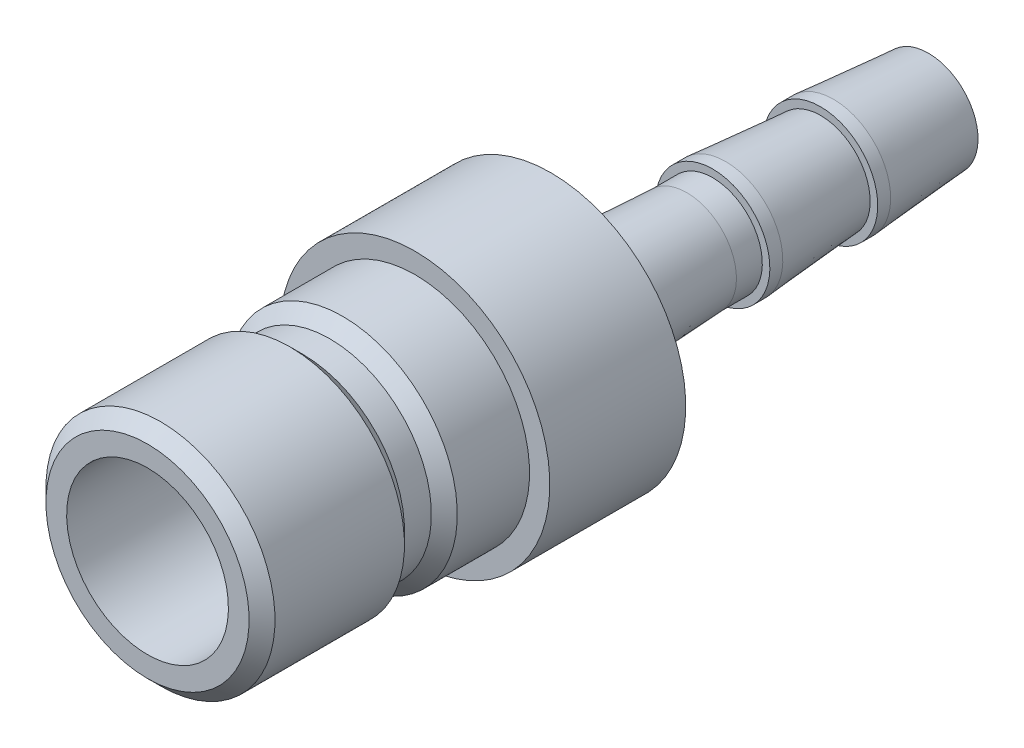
ISO-10303-21;
HEADER;
FILE_DESCRIPTION(('STEP AP214'),'2;1');
FILE_NAME('part.step','',(''),(''),'','','');
FILE_SCHEMA(('AUTOMOTIVE_DESIGN { 1 0 10303 214 1 1 1 1 }'));
ENDSEC;
DATA;
#1=APPLICATION_CONTEXT('core data for automotive mechanical design processes');
#2=APPLICATION_PROTOCOL_DEFINITION('international standard','automotive_design',2000,#1);
#3=PRODUCT_CONTEXT('',#1,'mechanical');
#4=PRODUCT('Part','Part','',(#3));
#5=PRODUCT_RELATED_PRODUCT_CATEGORY('part','',(#4));
#6=PRODUCT_DEFINITION_FORMATION('','',#4);
#7=PRODUCT_DEFINITION_CONTEXT('part definition',#1,'design');
#8=PRODUCT_DEFINITION('design','',#6,#7);
#9=PRODUCT_DEFINITION_SHAPE('','',#8);
#10=(LENGTH_UNIT() NAMED_UNIT(*) SI_UNIT(.MILLI.,.METRE.));
#11=(NAMED_UNIT(*) PLANE_ANGLE_UNIT() SI_UNIT($,.RADIAN.));
#12=(NAMED_UNIT(*) SI_UNIT($,.STERADIAN.) SOLID_ANGLE_UNIT());
#13=UNCERTAINTY_MEASURE_WITH_UNIT(LENGTH_MEASURE(1.E-05),#10,'distance_accuracy_value','');
#14=(GEOMETRIC_REPRESENTATION_CONTEXT(3) GLOBAL_UNCERTAINTY_ASSIGNED_CONTEXT((#13)) GLOBAL_UNIT_ASSIGNED_CONTEXT((#10,
#11,#12)) REPRESENTATION_CONTEXT('',''));
#15=CARTESIAN_POINT('',(0.,0.,0.));
#16=DIRECTION('',(0.,0.,1.));
#17=DIRECTION('',(1.,0.,0.));
#18=AXIS2_PLACEMENT_3D('',#15,#16,#17);
#19=CARTESIAN_POINT('',(0.,0.,0.));
#20=DIRECTION('',(0.,0.,-1.));
#21=DIRECTION('',(0.,1.,0.));
#22=AXIS2_PLACEMENT_3D('',#19,#20,#21);
#23=CYLINDRICAL_SURFACE('',#22,4.7625);
#24=CARTESIAN_POINT('',(0.,0.,3.556));
#25=DIRECTION('',(0.,0.,-1.));
#26=DIRECTION('',(0.,1.,0.));
#27=AXIS2_PLACEMENT_3D('',#24,#25,#26);
#28=CIRCLE('',#27,4.7625);
#29=CARTESIAN_POINT('',(0.,4.7625,3.556));
#30=VERTEX_POINT('',#29);
#31=EDGE_CURVE('E101',#30,#30,#28,.T.);
#32=ORIENTED_EDGE('',*,*,#31,.T.);
#33=EDGE_LOOP('',(#32));
#34=FACE_BOUND('',#33,.T.);
#35=CARTESIAN_POINT('',(0.,0.,15.748));
#36=DIRECTION('',(0.,0.,-1.));
#37=DIRECTION('',(0.,1.,0.));
#38=AXIS2_PLACEMENT_3D('',#35,#36,#37);
#39=CIRCLE('',#38,4.7625);
#40=CARTESIAN_POINT('',(0.,4.7625,15.748));
#41=VERTEX_POINT('',#40);
#42=EDGE_CURVE('E10',#41,#41,#39,.T.);
#43=ORIENTED_EDGE('',*,*,#42,.F.);
#44=EDGE_LOOP('',(#43));
#45=FACE_BOUND('',#44,.T.);
#46=ADVANCED_FACE('F31',(#34,#45),#23,.F.);
#47=CARTESIAN_POINT('',(0.,4.7625,15.748));
#48=DIRECTION('',(0.,0.,1.));
#49=DIRECTION('',(0.,-1.,0.));
#50=AXIS2_PLACEMENT_3D('',#47,#48,#49);
#51=PLANE('',#50);
#52=ORIENTED_EDGE('',*,*,#42,.T.);
#53=EDGE_LOOP('',(#52));
#54=FACE_BOUND('',#53,.T.);
#55=CARTESIAN_POINT('',(0.,0.,15.748));
#56=DIRECTION('',(0.,0.,-1.));
#57=DIRECTION('',(0.,1.,0.));
#58=AXIS2_PLACEMENT_3D('',#55,#56,#57);
#59=CIRCLE('',#58,5.9817);
#60=CARTESIAN_POINT('',(0.,5.9817,15.748));
#61=VERTEX_POINT('',#60);
#62=EDGE_CURVE('E37',#61,#61,#59,.T.);
#63=ORIENTED_EDGE('',*,*,#62,.F.);
#64=EDGE_LOOP('',(#63));
#65=FACE_BOUND('',#64,.T.);
#66=ADVANCED_FACE('F119',(#54,#65),#51,.T.);
#67=CARTESIAN_POINT('',(0.,0.,14.986));
#68=DIRECTION('',(0.,0.,-1.));
#69=DIRECTION('',(0.,1.,0.));
#70=AXIS2_PLACEMENT_3D('',#67,#68,#69);
#71=CONICAL_SURFACE('',#70,6.7437,0.785398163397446);
#72=ORIENTED_EDGE('',*,*,#62,.T.);
#73=EDGE_LOOP('',(#72));
#74=FACE_BOUND('',#73,.T.);
#75=CARTESIAN_POINT('',(0.,0.,14.986));
#76=DIRECTION('',(0.,0.,-1.));
#77=DIRECTION('',(0.,1.,0.));
#78=AXIS2_PLACEMENT_3D('',#75,#76,#77);
#79=CIRCLE('',#78,6.7437);
#80=CARTESIAN_POINT('',(0.,6.7437,14.986));
#81=VERTEX_POINT('',#80);
#82=EDGE_CURVE('E41',#81,#81,#79,.T.);
#83=ORIENTED_EDGE('',*,*,#82,.F.);
#84=EDGE_LOOP('',(#83));
#85=FACE_BOUND('',#84,.T.);
#86=ADVANCED_FACE('F123',(#74,#85),#71,.T.);
#87=CARTESIAN_POINT('',(0.,0.,0.));
#88=DIRECTION('',(0.,0.,-1.));
#89=DIRECTION('',(0.,1.,0.));
#90=AXIS2_PLACEMENT_3D('',#87,#88,#89);
#91=CYLINDRICAL_SURFACE('',#90,6.7437);
#92=ORIENTED_EDGE('',*,*,#82,.T.);
#93=EDGE_LOOP('',(#92));
#94=FACE_BOUND('',#93,.T.);
#95=CARTESIAN_POINT('',(0.,0.,7.36599999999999));
#96=DIRECTION('',(0.,0.,-1.));
#97=DIRECTION('',(0.,1.,0.));
#98=AXIS2_PLACEMENT_3D('',#95,#96,#97);
#99=CIRCLE('',#98,6.7437);
#100=CARTESIAN_POINT('',(0.,6.7437,7.36599999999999));
#101=VERTEX_POINT('',#100);
#102=EDGE_CURVE('E45',#101,#101,#99,.T.);
#103=ORIENTED_EDGE('',*,*,#102,.F.);
#104=EDGE_LOOP('',(#103));
#105=FACE_BOUND('',#104,.T.);
#106=ADVANCED_FACE('F127',(#94,#105),#91,.T.);
#107=CARTESIAN_POINT('',(0.,0.,6.604));
#108=DIRECTION('',(0.,0.,1.));
#109=DIRECTION('',(0.,-1.,0.));
#110=AXIS2_PLACEMENT_3D('',#107,#108,#109);
#111=CONICAL_SURFACE('',#110,5.9817,0.785398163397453);
#112=ORIENTED_EDGE('',*,*,#102,.T.);
#113=EDGE_LOOP('',(#112));
#114=FACE_BOUND('',#113,.T.);
#115=CARTESIAN_POINT('',(0.,0.,6.604));
#116=DIRECTION('',(0.,0.,-1.));
#117=DIRECTION('',(0.,1.,0.));
#118=AXIS2_PLACEMENT_3D('',#115,#116,#117);
#119=CIRCLE('',#118,5.9817);
#120=CARTESIAN_POINT('',(0.,5.9817,6.604));
#121=VERTEX_POINT('',#120);
#122=EDGE_CURVE('E50',#121,#121,#119,.T.);
#123=ORIENTED_EDGE('',*,*,#122,.F.);
#124=EDGE_LOOP('',(#123));
#125=FACE_BOUND('',#124,.T.);
#126=ADVANCED_FACE('F133',(#114,#125),#111,.T.);
#127=CARTESIAN_POINT('',(0.,0.,0.));
#128=DIRECTION('',(0.,0.,-1.));
#129=DIRECTION('',(0.,1.,0.));
#130=AXIS2_PLACEMENT_3D('',#127,#128,#129);
#131=CYLINDRICAL_SURFACE('',#130,5.9817);
#132=ORIENTED_EDGE('',*,*,#122,.T.);
#133=EDGE_LOOP('',(#132));
#134=FACE_BOUND('',#133,.T.);
#135=CARTESIAN_POINT('',(0.,0.,5.0165));
#136=DIRECTION('',(0.,0.,-1.));
#137=DIRECTION('',(0.,1.,0.));
#138=AXIS2_PLACEMENT_3D('',#135,#136,#137);
#139=CIRCLE('',#138,5.9817);
#140=CARTESIAN_POINT('',(0.,5.9817,5.0165));
#141=VERTEX_POINT('',#140);
#142=EDGE_CURVE('E53',#141,#141,#139,.T.);
#143=ORIENTED_EDGE('',*,*,#142,.F.);
#144=EDGE_LOOP('',(#143));
#145=FACE_BOUND('',#144,.T.);
#146=ADVANCED_FACE('F137',(#134,#145),#131,.T.);
#147=CARTESIAN_POINT('',(0.,0.,4.25449999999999));
#148=DIRECTION('',(0.,0.,-1.));
#149=DIRECTION('',(0.,1.,0.));
#150=AXIS2_PLACEMENT_3D('',#147,#148,#149);
#151=CONICAL_SURFACE('',#150,6.7437,0.785398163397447);
#152=ORIENTED_EDGE('',*,*,#142,.T.);
#153=EDGE_LOOP('',(#152));
#154=FACE_BOUND('',#153,.T.);
#155=CARTESIAN_POINT('',(0.,0.,4.25449999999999));
#156=DIRECTION('',(0.,0.,-1.));
#157=DIRECTION('',(0.,1.,0.));
#158=AXIS2_PLACEMENT_3D('',#155,#156,#157);
#159=CIRCLE('',#158,6.7437);
#160=CARTESIAN_POINT('',(0.,6.7437,4.25449999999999));
#161=VERTEX_POINT('',#160);
#162=EDGE_CURVE('E56',#161,#161,#159,.T.);
#163=ORIENTED_EDGE('',*,*,#162,.F.);
#164=EDGE_LOOP('',(#163));
#165=FACE_BOUND('',#164,.T.);
#166=ADVANCED_FACE('F141',(#154,#165),#151,.T.);
#167=CARTESIAN_POINT('',(0.,0.,0.));
#168=DIRECTION('',(0.,0.,-1.));
#169=DIRECTION('',(0.,1.,0.));
#170=AXIS2_PLACEMENT_3D('',#167,#168,#169);
#171=CYLINDRICAL_SURFACE('',#170,6.7437);
#172=ORIENTED_EDGE('',*,*,#162,.T.);
#173=EDGE_LOOP('',(#172));
#174=FACE_BOUND('',#173,.T.);
#175=CARTESIAN_POINT('',(0.,0.,0.));
#176=DIRECTION('',(0.,0.,-1.));
#177=DIRECTION('',(0.,1.,0.));
#178=AXIS2_PLACEMENT_3D('',#175,#176,#177);
#179=CIRCLE('',#178,6.7437);
#180=CARTESIAN_POINT('',(0.,6.7437,0.));
#181=VERTEX_POINT('',#180);
#182=EDGE_CURVE('E59',#181,#181,#179,.T.);
#183=ORIENTED_EDGE('',*,*,#182,.F.);
#184=EDGE_LOOP('',(#183));
#185=FACE_BOUND('',#184,.T.);
#186=ADVANCED_FACE('F145',(#174,#185),#171,.T.);
#187=CARTESIAN_POINT('',(0.,6.7437,0.));
#188=DIRECTION('',(0.,0.,1.));
#189=DIRECTION('',(0.,-1.,0.));
#190=AXIS2_PLACEMENT_3D('',#187,#188,#189);
#191=PLANE('',#190);
#192=ORIENTED_EDGE('',*,*,#182,.T.);
#193=EDGE_LOOP('',(#192));
#194=FACE_BOUND('',#193,.T.);
#195=CARTESIAN_POINT('',(0.,0.,0.));
#196=DIRECTION('',(0.,0.,-1.));
#197=DIRECTION('',(0.,1.,0.));
#198=AXIS2_PLACEMENT_3D('',#195,#196,#197);
#199=CIRCLE('',#198,7.9375);
#200=CARTESIAN_POINT('',(0.,7.9375,0.));
#201=VERTEX_POINT('',#200);
#202=EDGE_CURVE('E62',#201,#201,#199,.T.);
#203=ORIENTED_EDGE('',*,*,#202,.F.);
#204=EDGE_LOOP('',(#203));
#205=FACE_BOUND('',#204,.T.);
#206=ADVANCED_FACE('F149',(#194,#205),#191,.T.);
#207=CARTESIAN_POINT('',(0.,0.,0.));
#208=DIRECTION('',(0.,0.,-1.));
#209=DIRECTION('',(0.,1.,0.));
#210=AXIS2_PLACEMENT_3D('',#207,#208,#209);
#211=CYLINDRICAL_SURFACE('',#210,7.9375);
#212=ORIENTED_EDGE('',*,*,#202,.T.);
#213=EDGE_LOOP('',(#212));
#214=FACE_BOUND('',#213,.T.);
#215=CARTESIAN_POINT('',(0.,0.,-8.00100000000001));
#216=DIRECTION('',(0.,0.,-1.));
#217=DIRECTION('',(0.,1.,0.));
#218=AXIS2_PLACEMENT_3D('',#215,#216,#217);
#219=CIRCLE('',#218,7.9375);
#220=CARTESIAN_POINT('',(0.,7.9375,-8.001));
#221=VERTEX_POINT('',#220);
#222=EDGE_CURVE('E65',#221,#221,#219,.T.);
#223=ORIENTED_EDGE('',*,*,#222,.F.);
#224=EDGE_LOOP('',(#223));
#225=FACE_BOUND('',#224,.T.);
#226=ADVANCED_FACE('F153',(#214,#225),#211,.T.);
#227=CARTESIAN_POINT('',(0.,3.3655,-8.001));
#228=DIRECTION('',(0.,0.,-1.));
#229=DIRECTION('',(0.,1.,0.));
#230=AXIS2_PLACEMENT_3D('',#227,#228,#229);
#231=PLANE('',#230);
#232=ORIENTED_EDGE('',*,*,#222,.T.);
#233=EDGE_LOOP('',(#232));
#234=FACE_BOUND('',#233,.T.);
#235=CARTESIAN_POINT('',(0.,0.,-8.001));
#236=DIRECTION('',(0.,0.,-1.));
#237=DIRECTION('',(0.,1.,0.));
#238=AXIS2_PLACEMENT_3D('',#235,#236,#237);
#239=CIRCLE('',#238,3.3655);
#240=CARTESIAN_POINT('',(0.,3.3655,-8.001));
#241=VERTEX_POINT('',#240);
#242=EDGE_CURVE('E68',#241,#241,#239,.T.);
#243=ORIENTED_EDGE('',*,*,#242,.F.);
#244=EDGE_LOOP('',(#243));
#245=FACE_BOUND('',#244,.T.);
#246=ADVANCED_FACE('F157',(#234,#245),#231,.T.);
#247=CARTESIAN_POINT('',(0.,0.,-16.002));
#248=DIRECTION('',(0.,0.,1.));
#249=DIRECTION('',(0.,-1.,0.));
#250=AXIS2_PLACEMENT_3D('',#247,#248,#249);
#251=CONICAL_SURFACE('',#250,2.921,0.0554985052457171);
#252=ORIENTED_EDGE('',*,*,#242,.T.);
#253=EDGE_LOOP('',(#252));
#254=FACE_BOUND('',#253,.T.);
#255=CARTESIAN_POINT('',(0.,0.,-16.002));
#256=DIRECTION('',(0.,0.,-1.));
#257=DIRECTION('',(0.,1.,0.));
#258=AXIS2_PLACEMENT_3D('',#255,#256,#257);
#259=CIRCLE('',#258,2.921);
#260=CARTESIAN_POINT('',(0.,2.921,-16.002));
#261=VERTEX_POINT('',#260);
#262=EDGE_CURVE('E71',#261,#261,#259,.T.);
#263=ORIENTED_EDGE('',*,*,#262,.F.);
#264=EDGE_LOOP('',(#263));
#265=FACE_BOUND('',#264,.T.);
#266=ADVANCED_FACE('F161',(#254,#265),#251,.T.);
#267=CARTESIAN_POINT('',(0.,0.,0.));
#268=DIRECTION('',(0.,0.,-1.));
#269=DIRECTION('',(0.,1.,0.));
#270=AXIS2_PLACEMENT_3D('',#267,#268,#269);
#271=CYLINDRICAL_SURFACE('',#270,2.921);
#272=ORIENTED_EDGE('',*,*,#262,.T.);
#273=EDGE_LOOP('',(#272));
#274=FACE_BOUND('',#273,.T.);
#275=CARTESIAN_POINT('',(0.,0.,-17.526));
#276=DIRECTION('',(0.,0.,-1.));
#277=DIRECTION('',(0.,1.,0.));
#278=AXIS2_PLACEMENT_3D('',#275,#276,#277);
#279=CIRCLE('',#278,2.921);
#280=CARTESIAN_POINT('',(0.,2.921,-17.526));
#281=VERTEX_POINT('',#280);
#282=EDGE_CURVE('E74',#281,#281,#279,.T.);
#283=ORIENTED_EDGE('',*,*,#282,.F.);
#284=EDGE_LOOP('',(#283));
#285=FACE_BOUND('',#284,.T.);
#286=ADVANCED_FACE('F165',(#274,#285),#271,.T.);
#287=CARTESIAN_POINT('',(0.,3.3655,-17.526));
#288=DIRECTION('',(0.,0.,1.));
#289=DIRECTION('',(0.,-1.,0.));
#290=AXIS2_PLACEMENT_3D('',#287,#288,#289);
#291=PLANE('',#290);
#292=ORIENTED_EDGE('',*,*,#282,.T.);
#293=EDGE_LOOP('',(#292));
#294=FACE_BOUND('',#293,.T.);
#295=CARTESIAN_POINT('',(0.,0.,-17.526));
#296=DIRECTION('',(0.,0.,-1.));
#297=DIRECTION('',(0.,1.,0.));
#298=AXIS2_PLACEMENT_3D('',#295,#296,#297);
#299=CIRCLE('',#298,3.3655);
#300=CARTESIAN_POINT('',(0.,3.3655,-17.526));
#301=VERTEX_POINT('',#300);
#302=EDGE_CURVE('E77',#301,#301,#299,.T.);
#303=ORIENTED_EDGE('',*,*,#302,.F.);
#304=EDGE_LOOP('',(#303));
#305=FACE_BOUND('',#304,.T.);
#306=ADVANCED_FACE('F169',(#294,#305),#291,.T.);
#307=CARTESIAN_POINT('',(0.,0.,0.));
#308=DIRECTION('',(0.,0.,-1.));
#309=DIRECTION('',(0.,1.,0.));
#310=AXIS2_PLACEMENT_3D('',#307,#308,#309);
#311=CYLINDRICAL_SURFACE('',#310,3.3655);
#312=ORIENTED_EDGE('',*,*,#302,.T.);
#313=EDGE_LOOP('',(#312));
#314=FACE_BOUND('',#313,.T.);
#315=CARTESIAN_POINT('',(0.,0.,-18.288));
#316=DIRECTION('',(0.,0.,-1.));
#317=DIRECTION('',(0.,1.,0.));
#318=AXIS2_PLACEMENT_3D('',#315,#316,#317);
#319=CIRCLE('',#318,3.3655);
#320=CARTESIAN_POINT('',(0.,3.3655,-18.288));
#321=VERTEX_POINT('',#320);
#322=EDGE_CURVE('E80',#321,#321,#319,.T.);
#323=ORIENTED_EDGE('',*,*,#322,.F.);
#324=EDGE_LOOP('',(#323));
#325=FACE_BOUND('',#324,.T.);
#326=ADVANCED_FACE('F173',(#314,#325),#311,.T.);
#327=CARTESIAN_POINT('',(0.,0.,-23.876));
#328=DIRECTION('',(0.,0.,1.));
#329=DIRECTION('',(0.,-1.,0.));
#330=AXIS2_PLACEMENT_3D('',#327,#328,#329);
#331=CONICAL_SURFACE('',#330,2.921,0.0793783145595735);
#332=ORIENTED_EDGE('',*,*,#322,.T.);
#333=EDGE_LOOP('',(#332));
#334=FACE_BOUND('',#333,.T.);
#335=CARTESIAN_POINT('',(0.,0.,-23.876));
#336=DIRECTION('',(0.,0.,-1.));
#337=DIRECTION('',(0.,1.,0.));
#338=AXIS2_PLACEMENT_3D('',#335,#336,#337);
#339=CIRCLE('',#338,2.921);
#340=CARTESIAN_POINT('',(0.,2.921,-23.876));
#341=VERTEX_POINT('',#340);
#342=EDGE_CURVE('E83',#341,#341,#339,.T.);
#343=ORIENTED_EDGE('',*,*,#342,.F.);
#344=EDGE_LOOP('',(#343));
#345=FACE_BOUND('',#344,.T.);
#346=ADVANCED_FACE('F177',(#334,#345),#331,.T.);
#347=CARTESIAN_POINT('',(0.,3.3655,-23.876));
#348=DIRECTION('',(0.,0.,1.));
#349=DIRECTION('',(0.,-1.,0.));
#350=AXIS2_PLACEMENT_3D('',#347,#348,#349);
#351=PLANE('',#350);
#352=ORIENTED_EDGE('',*,*,#342,.T.);
#353=EDGE_LOOP('',(#352));
#354=FACE_BOUND('',#353,.T.);
#355=CARTESIAN_POINT('',(0.,0.,-23.876));
#356=DIRECTION('',(0.,0.,-1.));
#357=DIRECTION('',(0.,1.,0.));
#358=AXIS2_PLACEMENT_3D('',#355,#356,#357);
#359=CIRCLE('',#358,3.3655);
#360=CARTESIAN_POINT('',(0.,3.3655,-23.876));
#361=VERTEX_POINT('',#360);
#362=EDGE_CURVE('E86',#361,#361,#359,.T.);
#363=ORIENTED_EDGE('',*,*,#362,.F.);
#364=EDGE_LOOP('',(#363));
#365=FACE_BOUND('',#364,.T.);
#366=ADVANCED_FACE('F181',(#354,#365),#351,.T.);
#367=CARTESIAN_POINT('',(0.,0.,0.));
#368=DIRECTION('',(0.,0.,-1.));
#369=DIRECTION('',(0.,1.,0.));
#370=AXIS2_PLACEMENT_3D('',#367,#368,#369);
#371=CYLINDRICAL_SURFACE('',#370,3.3655);
#372=ORIENTED_EDGE('',*,*,#362,.T.);
#373=EDGE_LOOP('',(#372));
#374=FACE_BOUND('',#373,.T.);
#375=CARTESIAN_POINT('',(0.,0.,-24.638));
#376=DIRECTION('',(0.,0.,-1.));
#377=DIRECTION('',(0.,1.,0.));
#378=AXIS2_PLACEMENT_3D('',#375,#376,#377);
#379=CIRCLE('',#378,3.3655);
#380=CARTESIAN_POINT('',(0.,3.3655,-24.638));
#381=VERTEX_POINT('',#380);
#382=EDGE_CURVE('E89',#381,#381,#379,.T.);
#383=ORIENTED_EDGE('',*,*,#382,.F.);
#384=EDGE_LOOP('',(#383));
#385=FACE_BOUND('',#384,.T.);
#386=ADVANCED_FACE('F185',(#374,#385),#371,.T.);
#387=CARTESIAN_POINT('',(0.,0.,-30.226));
#388=DIRECTION('',(0.,0.,1.));
#389=DIRECTION('',(0.,-1.,0.));
#390=AXIS2_PLACEMENT_3D('',#387,#388,#389);
#391=CONICAL_SURFACE('',#390,2.921,0.0793783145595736);
#392=ORIENTED_EDGE('',*,*,#382,.T.);
#393=EDGE_LOOP('',(#392));
#394=FACE_BOUND('',#393,.T.);
#395=CARTESIAN_POINT('',(0.,0.,-30.226));
#396=DIRECTION('',(0.,0.,-1.));
#397=DIRECTION('',(0.,1.,0.));
#398=AXIS2_PLACEMENT_3D('',#395,#396,#397);
#399=CIRCLE('',#398,2.921);
#400=CARTESIAN_POINT('',(0.,2.921,-30.226));
#401=VERTEX_POINT('',#400);
#402=EDGE_CURVE('E92',#401,#401,#399,.T.);
#403=ORIENTED_EDGE('',*,*,#402,.F.);
#404=EDGE_LOOP('',(#403));
#405=FACE_BOUND('',#404,.T.);
#406=ADVANCED_FACE('F189',(#394,#405),#391,.T.);
#407=CARTESIAN_POINT('',(0.,2.921,-30.226));
#408=DIRECTION('',(0.,0.,-1.));
#409=DIRECTION('',(0.,1.,0.));
#410=AXIS2_PLACEMENT_3D('',#407,#408,#409);
#411=PLANE('',#410);
#412=ORIENTED_EDGE('',*,*,#402,.T.);
#413=EDGE_LOOP('',(#412));
#414=FACE_BOUND('',#413,.T.);
#415=CARTESIAN_POINT('',(0.,0.,-30.226));
#416=DIRECTION('',(0.,0.,-1.));
#417=DIRECTION('',(0.,1.,0.));
#418=AXIS2_PLACEMENT_3D('',#415,#416,#417);
#419=CIRCLE('',#418,2.38125);
#420=CARTESIAN_POINT('',(0.,2.38125,-30.226));
#421=VERTEX_POINT('',#420);
#422=EDGE_CURVE('E95',#421,#421,#419,.T.);
#423=ORIENTED_EDGE('',*,*,#422,.F.);
#424=EDGE_LOOP('',(#423));
#425=FACE_BOUND('',#424,.T.);
#426=ADVANCED_FACE('F115',(#414,#425),#411,.T.);
#427=CARTESIAN_POINT('',(0.,0.,0.));
#428=DIRECTION('',(0.,0.,-1.));
#429=DIRECTION('',(0.,1.,0.));
#430=AXIS2_PLACEMENT_3D('',#427,#428,#429);
#431=CYLINDRICAL_SURFACE('',#430,2.38125);
#432=ORIENTED_EDGE('',*,*,#422,.T.);
#433=EDGE_LOOP('',(#432));
#434=FACE_BOUND('',#433,.T.);
#435=CARTESIAN_POINT('',(0.,0.,0.691870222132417));
#436=DIRECTION('',(0.,0.,-1.));
#437=DIRECTION('',(0.,1.,0.));
#438=AXIS2_PLACEMENT_3D('',#435,#436,#437);
#439=CIRCLE('',#438,2.38125);
#440=CARTESIAN_POINT('',(0.,2.38125,0.691870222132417));
#441=VERTEX_POINT('',#440);
#442=EDGE_CURVE('E98',#441,#441,#439,.T.);
#443=ORIENTED_EDGE('',*,*,#442,.F.);
#444=EDGE_LOOP('',(#443));
#445=FACE_BOUND('',#444,.T.);
#446=ADVANCED_FACE('F109',(#434,#445),#431,.F.);
#447=CARTESIAN_POINT('',(0.,0.,3.556));
#448=DIRECTION('',(0.,0.,1.));
#449=DIRECTION('',(0.,-1.,0.));
#450=AXIS2_PLACEMENT_3D('',#447,#448,#449);
#451=CONICAL_SURFACE('',#450,4.7625,0.693598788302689);
#452=ORIENTED_EDGE('',*,*,#442,.T.);
#453=EDGE_LOOP('',(#452));
#454=FACE_BOUND('',#453,.T.);
#455=ORIENTED_EDGE('',*,*,#31,.F.);
#456=EDGE_LOOP('',(#455));
#457=FACE_BOUND('',#456,.T.);
#458=ADVANCED_FACE('F107',(#454,#457),#451,.F.);
#459=CLOSED_SHELL('',(#46,#66,#86,#106,#126,#146,#166,#186,#206,#226,#246,#266,#286,#306,#326,
#346,#366,#386,#406,#426,#446,#458));
#460=MANIFOLD_SOLID_BREP('B2',#459);
#461=ADVANCED_BREP_SHAPE_REPRESENTATION('',(#18,#460),#14);
#462=SHAPE_DEFINITION_REPRESENTATION(#9,#461);
ENDSEC;
END-ISO-10303-21;
